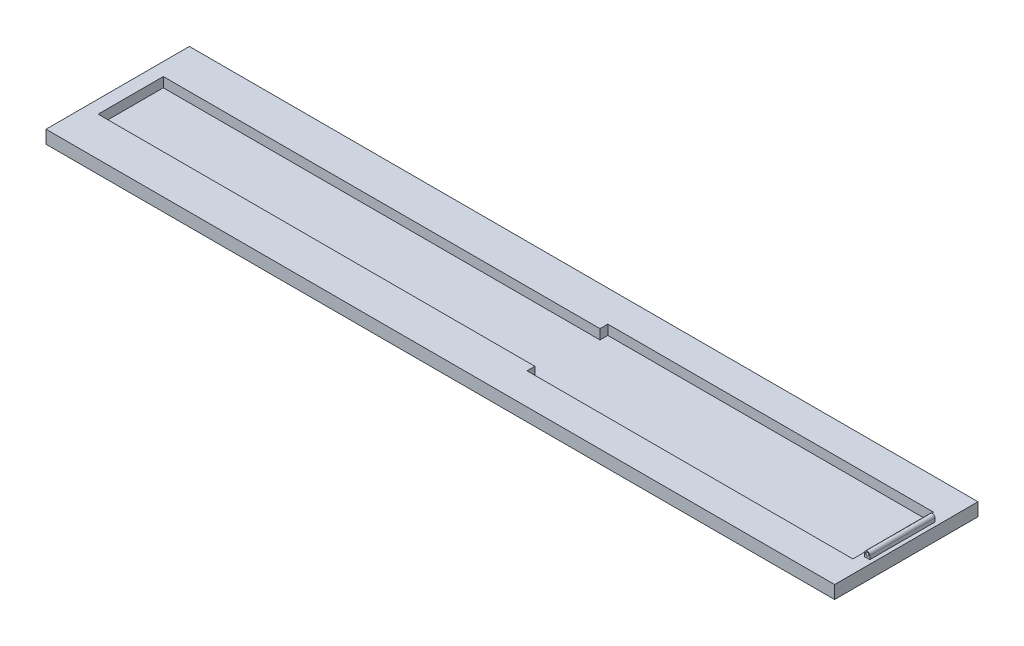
ISO-10303-21;
HEADER;
FILE_DESCRIPTION(('STEP AP214'),'2;1');
FILE_NAME('part.step','',(''),(''),'','','');
FILE_SCHEMA(('AUTOMOTIVE_DESIGN { 1 0 10303 214 1 1 1 1 }'));
ENDSEC;
DATA;
#1=APPLICATION_CONTEXT('core data for automotive mechanical design processes');
#2=APPLICATION_PROTOCOL_DEFINITION('international standard','automotive_design',2000,#1);
#3=PRODUCT_CONTEXT('',#1,'mechanical');
#4=PRODUCT('Part','Part','',(#3));
#5=PRODUCT_RELATED_PRODUCT_CATEGORY('part','',(#4));
#6=PRODUCT_DEFINITION_FORMATION('','',#4);
#7=PRODUCT_DEFINITION_CONTEXT('part definition',#1,'design');
#8=PRODUCT_DEFINITION('design','',#6,#7);
#9=PRODUCT_DEFINITION_SHAPE('','',#8);
#10=(LENGTH_UNIT() NAMED_UNIT(*) SI_UNIT(.MILLI.,.METRE.));
#11=(NAMED_UNIT(*) PLANE_ANGLE_UNIT() SI_UNIT($,.RADIAN.));
#12=(NAMED_UNIT(*) SI_UNIT($,.STERADIAN.) SOLID_ANGLE_UNIT());
#13=UNCERTAINTY_MEASURE_WITH_UNIT(LENGTH_MEASURE(1.E-05),#10,'distance_accuracy_value','');
#14=(GEOMETRIC_REPRESENTATION_CONTEXT(3) GLOBAL_UNCERTAINTY_ASSIGNED_CONTEXT((#13)) GLOBAL_UNIT_ASSIGNED_CONTEXT((#10,
#11,#12)) REPRESENTATION_CONTEXT('',''));
#15=CARTESIAN_POINT('',(0.,0.,0.));
#16=DIRECTION('',(0.,0.,1.));
#17=DIRECTION('',(1.,0.,0.));
#18=AXIS2_PLACEMENT_3D('',#15,#16,#17);
#19=CARTESIAN_POINT('',(-12000.,-55.,1100.));
#20=DIRECTION('',(0.,-1.,0.));
#21=DIRECTION('',(0.,0.,-1.));
#22=AXIS2_PLACEMENT_3D('',#19,#20,#21);
#23=PLANE('',#22);
#24=DIRECTION('',(-1.,0.,0.));
#25=VECTOR('',#24,1.);
#26=CARTESIAN_POINT('',(-5100.,-55.,-500.));
#27=LINE('',#26,#25);
#28=CARTESIAN_POINT('',(-5100.,-55.,-500.));
#29=VERTEX_POINT('',#28);
#30=CARTESIAN_POINT('',(-11800.,-55.,-499.999999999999));
#31=VERTEX_POINT('',#30);
#32=EDGE_CURVE('E185',#29,#31,#27,.T.);
#33=ORIENTED_EDGE('',*,*,#32,.F.);
#34=DIRECTION('',(0.,0.,1.));
#35=VECTOR('',#34,1.);
#36=CARTESIAN_POINT('',(-5100.,-55.,-620.));
#37=LINE('',#36,#35);
#38=CARTESIAN_POINT('',(-5100.,-55.,-620.));
#39=VERTEX_POINT('',#38);
#40=EDGE_CURVE('E46',#39,#29,#37,.T.);
#41=ORIENTED_EDGE('',*,*,#40,.F.);
#42=DIRECTION('',(-1.,0.,0.));
#43=VECTOR('',#42,1.);
#44=CARTESIAN_POINT('',(-5100.,-55.,-620.));
#45=LINE('',#44,#43);
#46=CARTESIAN_POINT('',(-100.,-55.,-620.));
#47=VERTEX_POINT('',#46);
#48=EDGE_CURVE('E165',#47,#39,#45,.T.);
#49=ORIENTED_EDGE('',*,*,#48,.F.);
#50=DIRECTION('',(0.,0.,-1.));
#51=VECTOR('',#50,1.);
#52=CARTESIAN_POINT('',(-100.,-55.,-620.));
#53=LINE('',#52,#51);
#54=CARTESIAN_POINT('',(-100.,-55.,620.));
#55=VERTEX_POINT('',#54);
#56=EDGE_CURVE('E168',#55,#47,#53,.T.);
#57=ORIENTED_EDGE('',*,*,#56,.F.);
#58=DIRECTION('',(1.,0.,0.));
#59=VECTOR('',#58,1.);
#60=CARTESIAN_POINT('',(-5100.,-55.,620.));
#61=LINE('',#60,#59);
#62=CARTESIAN_POINT('',(-5100.,-55.,620.));
#63=VERTEX_POINT('',#62);
#64=EDGE_CURVE('E196',#63,#55,#61,.T.);
#65=ORIENTED_EDGE('',*,*,#64,.F.);
#66=DIRECTION('',(0.,0.,1.));
#67=VECTOR('',#66,1.);
#68=CARTESIAN_POINT('',(-5100.,-55.,500.));
#69=LINE('',#68,#67);
#70=CARTESIAN_POINT('',(-5100.,-55.,500.));
#71=VERTEX_POINT('',#70);
#72=EDGE_CURVE('E193',#71,#63,#69,.T.);
#73=ORIENTED_EDGE('',*,*,#72,.F.);
#74=DIRECTION('',(1.,0.,0.));
#75=VECTOR('',#74,1.);
#76=CARTESIAN_POINT('',(-5100.,-55.,500.));
#77=LINE('',#76,#75);
#78=CARTESIAN_POINT('',(-11800.,-55.,500.000000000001));
#79=VERTEX_POINT('',#78);
#80=EDGE_CURVE('E190',#79,#71,#77,.T.);
#81=ORIENTED_EDGE('',*,*,#80,.F.);
#82=DIRECTION('',(0.,0.,1.));
#83=VECTOR('',#82,1.);
#84=CARTESIAN_POINT('',(-11800.,-55.,-499.999999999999));
#85=LINE('',#84,#83);
#86=EDGE_CURVE('E187',#31,#79,#85,.T.);
#87=ORIENTED_EDGE('',*,*,#86,.F.);
#88=EDGE_LOOP('',(#33,#41,#49,#57,#65,#73,#81,#87));
#89=FACE_BOUND('',#88,.T.);
#90=DIRECTION('',(-1.,0.,0.));
#91=VECTOR('',#90,1.);
#92=CARTESIAN_POINT('',(-12000.,-55.,-1100.));
#93=LINE('',#92,#91);
#94=CARTESIAN_POINT('',(100.,-55.,-1100.));
#95=VERTEX_POINT('',#94);
#96=CARTESIAN_POINT('',(-12000.,-55.,-1100.));
#97=VERTEX_POINT('',#96);
#98=EDGE_CURVE('E254',#95,#97,#93,.T.);
#99=ORIENTED_EDGE('',*,*,#98,.T.);
#100=DIRECTION('',(0.,0.,-1.));
#101=VECTOR('',#100,1.);
#102=CARTESIAN_POINT('',(-12000.,-55.,1100.));
#103=LINE('',#102,#101);
#104=CARTESIAN_POINT('',(-12000.,-55.,1100.));
#105=VERTEX_POINT('',#104);
#106=EDGE_CURVE('E260',#105,#97,#103,.T.);
#107=ORIENTED_EDGE('',*,*,#106,.F.);
#108=DIRECTION('',(-1.,0.,0.));
#109=VECTOR('',#108,1.);
#110=CARTESIAN_POINT('',(-12000.,-55.,1100.));
#111=LINE('',#110,#109);
#112=CARTESIAN_POINT('',(100.,-55.,1100.));
#113=VERTEX_POINT('',#112);
#114=EDGE_CURVE('E258',#113,#105,#111,.T.);
#115=ORIENTED_EDGE('',*,*,#114,.F.);
#116=DIRECTION('',(0.,0.,-1.));
#117=VECTOR('',#116,1.);
#118=CARTESIAN_POINT('',(100.,-55.,1100.));
#119=LINE('',#118,#117);
#120=EDGE_CURVE('E270',#113,#95,#119,.T.);
#121=ORIENTED_EDGE('',*,*,#120,.T.);
#122=EDGE_LOOP('',(#99,#107,#115,#121));
#123=FACE_BOUND('',#122,.T.);
#124=DIRECTION('',(0.,0.,-1.));
#125=VECTOR('',#124,1.);
#126=CARTESIAN_POINT('',(-40.,-55.,500.));
#127=LINE('',#126,#125);
#128=CARTESIAN_POINT('',(-39.9999999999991,-55.,500.));
#129=VERTEX_POINT('',#128);
#130=CARTESIAN_POINT('',(-39.9999999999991,-55.,-500.));
#131=VERTEX_POINT('',#130);
#132=EDGE_CURVE('E244',#129,#131,#127,.T.);
#133=ORIENTED_EDGE('',*,*,#132,.T.);
#134=DIRECTION('',(1.,0.,0.));
#135=VECTOR('',#134,1.);
#136=CARTESIAN_POINT('',(-40.,-55.,-500.));
#137=LINE('',#136,#135);
#138=CARTESIAN_POINT('',(40.,-55.,-500.));
#139=VERTEX_POINT('',#138);
#140=EDGE_CURVE('E236',#131,#139,#137,.T.);
#141=ORIENTED_EDGE('',*,*,#140,.T.);
#142=DIRECTION('',(0.,0.,-1.));
#143=VECTOR('',#142,1.);
#144=CARTESIAN_POINT('',(40.,-55.,500.));
#145=LINE('',#144,#143);
#146=CARTESIAN_POINT('',(39.9999999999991,-55.,500.));
#147=VERTEX_POINT('',#146);
#148=EDGE_CURVE('E241',#147,#139,#145,.T.);
#149=ORIENTED_EDGE('',*,*,#148,.F.);
#150=DIRECTION('',(1.,0.,0.));
#151=VECTOR('',#150,1.);
#152=CARTESIAN_POINT('',(-40.,-55.,500.));
#153=LINE('',#152,#151);
#154=EDGE_CURVE('E54',#129,#147,#153,.T.);
#155=ORIENTED_EDGE('',*,*,#154,.F.);
#156=EDGE_LOOP('',(#133,#141,#149,#155));
#157=FACE_BOUND('',#156,.T.);
#158=ADVANCED_FACE('F31',(#89,#123,#157),#23,.F.);
#159=CARTESIAN_POINT('',(-12000.,-55.,1100.));
#160=DIRECTION('',(1.,0.,0.));
#161=DIRECTION('',(0.,0.,-1.));
#162=AXIS2_PLACEMENT_3D('',#159,#160,#161);
#163=PLANE('',#162);
#164=DIRECTION('',(0.,-1.,0.));
#165=VECTOR('',#164,1.);
#166=CARTESIAN_POINT('',(-12000.,-55.,-1100.));
#167=LINE('',#166,#165);
#168=CARTESIAN_POINT('',(-12000.,-255.,-1100.));
#169=VERTEX_POINT('',#168);
#170=EDGE_CURVE('E249',#97,#169,#167,.T.);
#171=ORIENTED_EDGE('',*,*,#170,.T.);
#172=DIRECTION('',(0.,0.,-1.));
#173=VECTOR('',#172,1.);
#174=CARTESIAN_POINT('',(-12000.,-255.,1100.));
#175=LINE('',#174,#173);
#176=CARTESIAN_POINT('',(-12000.,-255.,1100.));
#177=VERTEX_POINT('',#176);
#178=EDGE_CURVE('E11',#177,#169,#175,.T.);
#179=ORIENTED_EDGE('',*,*,#178,.F.);
#180=DIRECTION('',(0.,-1.,0.));
#181=VECTOR('',#180,1.);
#182=CARTESIAN_POINT('',(-12000.,-55.,1100.));
#183=LINE('',#182,#181);
#184=EDGE_CURVE('E250',#105,#177,#183,.T.);
#185=ORIENTED_EDGE('',*,*,#184,.F.);
#186=ORIENTED_EDGE('',*,*,#106,.T.);
#187=EDGE_LOOP('',(#171,#179,#185,#186));
#188=FACE_BOUND('',#187,.T.);
#189=ADVANCED_FACE('F33',(#188),#163,.F.);
#190=CARTESIAN_POINT('',(-12000.,-255.,1100.));
#191=DIRECTION('',(0.,1.,0.));
#192=DIRECTION('',(0.,0.,1.));
#193=AXIS2_PLACEMENT_3D('',#190,#191,#192);
#194=PLANE('',#193);
#195=DIRECTION('',(1.,0.,0.));
#196=VECTOR('',#195,1.);
#197=CARTESIAN_POINT('',(-12000.,-255.,-1100.));
#198=LINE('',#197,#196);
#199=CARTESIAN_POINT('',(100.,-255.,-1100.));
#200=VERTEX_POINT('',#199);
#201=EDGE_CURVE('E263',#169,#200,#198,.T.);
#202=ORIENTED_EDGE('',*,*,#201,.T.);
#203=DIRECTION('',(0.,0.,-1.));
#204=VECTOR('',#203,1.);
#205=CARTESIAN_POINT('',(100.,-255.,1100.));
#206=LINE('',#205,#204);
#207=CARTESIAN_POINT('',(100.,-255.,1100.));
#208=VERTEX_POINT('',#207);
#209=EDGE_CURVE('E39',#208,#200,#206,.T.);
#210=ORIENTED_EDGE('',*,*,#209,.F.);
#211=DIRECTION('',(1.,0.,0.));
#212=VECTOR('',#211,1.);
#213=CARTESIAN_POINT('',(-12000.,-255.,1100.));
#214=LINE('',#213,#212);
#215=EDGE_CURVE('E253',#177,#208,#214,.T.);
#216=ORIENTED_EDGE('',*,*,#215,.F.);
#217=ORIENTED_EDGE('',*,*,#178,.T.);
#218=EDGE_LOOP('',(#202,#210,#216,#217));
#219=FACE_BOUND('',#218,.T.);
#220=ADVANCED_FACE('F292',(#219),#194,.F.);
#221=CARTESIAN_POINT('',(100.,-55.,1100.));
#222=DIRECTION('',(-1.,0.,0.));
#223=DIRECTION('',(0.,-1.,0.));
#224=AXIS2_PLACEMENT_3D('',#221,#222,#223);
#225=PLANE('',#224);
#226=DIRECTION('',(0.,1.,0.));
#227=VECTOR('',#226,1.);
#228=CARTESIAN_POINT('',(100.,-55.,-1100.));
#229=LINE('',#228,#227);
#230=EDGE_CURVE('E265',#200,#95,#229,.T.);
#231=ORIENTED_EDGE('',*,*,#230,.T.);
#232=ORIENTED_EDGE('',*,*,#120,.F.);
#233=DIRECTION('',(0.,1.,0.));
#234=VECTOR('',#233,1.);
#235=CARTESIAN_POINT('',(100.,-55.,1100.));
#236=LINE('',#235,#234);
#237=EDGE_CURVE('E256',#208,#113,#236,.T.);
#238=ORIENTED_EDGE('',*,*,#237,.F.);
#239=ORIENTED_EDGE('',*,*,#209,.T.);
#240=EDGE_LOOP('',(#231,#232,#238,#239));
#241=FACE_BOUND('',#240,.T.);
#242=ADVANCED_FACE('F277',(#241),#225,.F.);
#243=CARTESIAN_POINT('',(-12000.,-255.,1100.));
#244=DIRECTION('',(0.,0.,1.));
#245=DIRECTION('',(1.,0.,0.));
#246=AXIS2_PLACEMENT_3D('',#243,#244,#245);
#247=PLANE('',#246);
#248=ORIENTED_EDGE('',*,*,#184,.T.);
#249=ORIENTED_EDGE('',*,*,#215,.T.);
#250=ORIENTED_EDGE('',*,*,#237,.T.);
#251=ORIENTED_EDGE('',*,*,#114,.T.);
#252=EDGE_LOOP('',(#248,#249,#250,#251));
#253=FACE_BOUND('',#252,.T.);
#254=ADVANCED_FACE('F291',(#253),#247,.T.);
#255=CARTESIAN_POINT('',(-12000.,-255.,-1100.));
#256=DIRECTION('',(0.,0.,1.));
#257=DIRECTION('',(1.,0.,0.));
#258=AXIS2_PLACEMENT_3D('',#255,#256,#257);
#259=PLANE('',#258);
#260=ORIENTED_EDGE('',*,*,#170,.F.);
#261=ORIENTED_EDGE('',*,*,#98,.F.);
#262=ORIENTED_EDGE('',*,*,#230,.F.);
#263=ORIENTED_EDGE('',*,*,#201,.F.);
#264=EDGE_LOOP('',(#260,#261,#262,#263));
#265=FACE_BOUND('',#264,.T.);
#266=ADVANCED_FACE('F283',(#265),#259,.F.);
#267=CARTESIAN_POINT('',(0.,0.,500.));
#268=DIRECTION('',(0.,0.,1.));
#269=DIRECTION('',(1.,0.,0.));
#270=AXIS2_PLACEMENT_3D('',#267,#268,#269);
#271=PLANE('',#270);
#272=CARTESIAN_POINT('',(0.,0.,500.));
#273=DIRECTION('',(0.,0.,1.));
#274=DIRECTION('',(1.,0.,0.));
#275=AXIS2_PLACEMENT_3D('',#272,#273,#274);
#276=CIRCLE('',#275,40.);
#277=CARTESIAN_POINT('',(40.,0.,500.));
#278=VERTEX_POINT('',#277);
#279=CARTESIAN_POINT('',(-40.,0.,500.));
#280=VERTEX_POINT('',#279);
#281=EDGE_CURVE('E221',#278,#280,#276,.T.);
#282=ORIENTED_EDGE('',*,*,#281,.T.);
#283=DIRECTION('',(0.,-1.,0.));
#284=VECTOR('',#283,1.);
#285=CARTESIAN_POINT('',(-40.,0.,500.));
#286=LINE('',#285,#284);
#287=EDGE_CURVE('E224',#280,#129,#286,.T.);
#288=ORIENTED_EDGE('',*,*,#287,.T.);
#289=ORIENTED_EDGE('',*,*,#154,.T.);
#290=DIRECTION('',(0.,1.,0.));
#291=VECTOR('',#290,1.);
#292=CARTESIAN_POINT('',(40.,-55.,500.));
#293=LINE('',#292,#291);
#294=EDGE_CURVE('E228',#147,#278,#293,.T.);
#295=ORIENTED_EDGE('',*,*,#294,.T.);
#296=EDGE_LOOP('',(#282,#288,#289,#295));
#297=FACE_BOUND('',#296,.T.);
#298=CARTESIAN_POINT('',(0.,0.,500.));
#299=DIRECTION('',(0.,0.,1.));
#300=DIRECTION('',(1.,0.,0.));
#301=AXIS2_PLACEMENT_3D('',#298,#299,#300);
#302=CIRCLE('',#301,25.);
#303=CARTESIAN_POINT('',(25.,0.,500.));
#304=VERTEX_POINT('',#303);
#305=EDGE_CURVE('E215',#304,#304,#302,.T.);
#306=ORIENTED_EDGE('',*,*,#305,.F.);
#307=EDGE_LOOP('',(#306));
#308=FACE_BOUND('',#307,.T.);
#309=ADVANCED_FACE('F307',(#297,#308),#271,.T.);
#310=CARTESIAN_POINT('',(0.,0.,-500.));
#311=DIRECTION('',(0.,0.,1.));
#312=DIRECTION('',(1.,0.,0.));
#313=AXIS2_PLACEMENT_3D('',#310,#311,#312);
#314=PLANE('',#313);
#315=CARTESIAN_POINT('',(0.,0.,-500.));
#316=DIRECTION('',(0.,0.,1.));
#317=DIRECTION('',(1.,0.,0.));
#318=AXIS2_PLACEMENT_3D('',#315,#316,#317);
#319=CIRCLE('',#318,40.);
#320=CARTESIAN_POINT('',(40.,0.,-500.));
#321=VERTEX_POINT('',#320);
#322=CARTESIAN_POINT('',(-40.,0.,-500.));
#323=VERTEX_POINT('',#322);
#324=EDGE_CURVE('E218',#321,#323,#319,.T.);
#325=ORIENTED_EDGE('',*,*,#324,.F.);
#326=DIRECTION('',(0.,1.,0.));
#327=VECTOR('',#326,1.);
#328=CARTESIAN_POINT('',(40.,-55.,-500.));
#329=LINE('',#328,#327);
#330=EDGE_CURVE('E225',#139,#321,#329,.T.);
#331=ORIENTED_EDGE('',*,*,#330,.F.);
#332=ORIENTED_EDGE('',*,*,#140,.F.);
#333=DIRECTION('',(0.,-1.,0.));
#334=VECTOR('',#333,1.);
#335=CARTESIAN_POINT('',(-40.,0.,-500.));
#336=LINE('',#335,#334);
#337=EDGE_CURVE('E233',#323,#131,#336,.T.);
#338=ORIENTED_EDGE('',*,*,#337,.F.);
#339=EDGE_LOOP('',(#325,#331,#332,#338));
#340=FACE_BOUND('',#339,.T.);
#341=CARTESIAN_POINT('',(0.,0.,-500.));
#342=DIRECTION('',(0.,0.,1.));
#343=DIRECTION('',(1.,0.,0.));
#344=AXIS2_PLACEMENT_3D('',#341,#342,#343);
#345=CIRCLE('',#344,25.);
#346=CARTESIAN_POINT('',(25.,0.,-500.));
#347=VERTEX_POINT('',#346);
#348=EDGE_CURVE('E203',#347,#347,#345,.T.);
#349=ORIENTED_EDGE('',*,*,#348,.T.);
#350=EDGE_LOOP('',(#349));
#351=FACE_BOUND('',#350,.T.);
#352=ADVANCED_FACE('F314',(#340,#351),#314,.F.);
#353=CARTESIAN_POINT('',(0.,0.,500.));
#354=DIRECTION('',(0.,0.,-1.));
#355=DIRECTION('',(-1.,0.,0.));
#356=AXIS2_PLACEMENT_3D('',#353,#354,#355);
#357=CYLINDRICAL_SURFACE('',#356,40.);
#358=ORIENTED_EDGE('',*,*,#324,.T.);
#359=DIRECTION('',(0.,0.,-1.));
#360=VECTOR('',#359,1.);
#361=CARTESIAN_POINT('',(-40.,0.,500.));
#362=LINE('',#361,#360);
#363=EDGE_CURVE('E246',#280,#323,#362,.T.);
#364=ORIENTED_EDGE('',*,*,#363,.F.);
#365=ORIENTED_EDGE('',*,*,#281,.F.);
#366=DIRECTION('',(0.,0.,-1.));
#367=VECTOR('',#366,1.);
#368=CARTESIAN_POINT('',(40.,0.,500.));
#369=LINE('',#368,#367);
#370=EDGE_CURVE('E230',#278,#321,#369,.T.);
#371=ORIENTED_EDGE('',*,*,#370,.T.);
#372=EDGE_LOOP('',(#358,#364,#365,#371));
#373=FACE_BOUND('',#372,.T.);
#374=ADVANCED_FACE('F310',(#373),#357,.T.);
#375=CARTESIAN_POINT('',(-40.,0.,500.));
#376=DIRECTION('',(1.,0.,0.));
#377=DIRECTION('',(0.,1.,0.));
#378=AXIS2_PLACEMENT_3D('',#375,#376,#377);
#379=PLANE('',#378);
#380=ORIENTED_EDGE('',*,*,#337,.T.);
#381=ORIENTED_EDGE('',*,*,#132,.F.);
#382=ORIENTED_EDGE('',*,*,#287,.F.);
#383=ORIENTED_EDGE('',*,*,#363,.T.);
#384=EDGE_LOOP('',(#380,#381,#382,#383));
#385=FACE_BOUND('',#384,.T.);
#386=ADVANCED_FACE('F313',(#385),#379,.F.);
#387=CARTESIAN_POINT('',(40.,-55.,500.));
#388=DIRECTION('',(-1.,0.,0.));
#389=DIRECTION('',(0.,0.,1.));
#390=AXIS2_PLACEMENT_3D('',#387,#388,#389);
#391=PLANE('',#390);
#392=ORIENTED_EDGE('',*,*,#330,.T.);
#393=ORIENTED_EDGE('',*,*,#370,.F.);
#394=ORIENTED_EDGE('',*,*,#294,.F.);
#395=ORIENTED_EDGE('',*,*,#148,.T.);
#396=EDGE_LOOP('',(#392,#393,#394,#395));
#397=FACE_BOUND('',#396,.T.);
#398=ADVANCED_FACE('F318',(#397),#391,.F.);
#399=CARTESIAN_POINT('',(0.,0.,500.));
#400=DIRECTION('',(0.,0.,-1.));
#401=DIRECTION('',(-1.,0.,0.));
#402=AXIS2_PLACEMENT_3D('',#399,#400,#401);
#403=CYLINDRICAL_SURFACE('',#402,25.);
#404=ORIENTED_EDGE('',*,*,#305,.T.);
#405=EDGE_LOOP('',(#404));
#406=FACE_BOUND('',#405,.T.);
#407=ORIENTED_EDGE('',*,*,#348,.F.);
#408=EDGE_LOOP('',(#407));
#409=FACE_BOUND('',#408,.T.);
#410=ADVANCED_FACE('F322',(#406,#409),#403,.F.);
#411=CARTESIAN_POINT('',(-5100.,-205.,-620.));
#412=DIRECTION('',(-1.,0.,0.));
#413=DIRECTION('',(0.,0.,1.));
#414=AXIS2_PLACEMENT_3D('',#411,#412,#413);
#415=PLANE('',#414);
#416=ORIENTED_EDGE('',*,*,#40,.T.);
#417=DIRECTION('',(0.,1.,0.));
#418=VECTOR('',#417,1.);
#419=CARTESIAN_POINT('',(-5100.,-205.,-500.));
#420=LINE('',#419,#418);
#421=CARTESIAN_POINT('',(-5100.,-205.,-500.));
#422=VERTEX_POINT('',#421);
#423=EDGE_CURVE('E142',#422,#29,#420,.T.);
#424=ORIENTED_EDGE('',*,*,#423,.F.);
#425=DIRECTION('',(0.,0.,1.));
#426=VECTOR('',#425,1.);
#427=CARTESIAN_POINT('',(-5100.,-205.,-620.));
#428=LINE('',#427,#426);
#429=CARTESIAN_POINT('',(-5100.,-205.,-620.));
#430=VERTEX_POINT('',#429);
#431=EDGE_CURVE('E146',#430,#422,#428,.T.);
#432=ORIENTED_EDGE('',*,*,#431,.F.);
#433=DIRECTION('',(0.,1.,0.));
#434=VECTOR('',#433,1.);
#435=CARTESIAN_POINT('',(-5100.,-205.,-620.));
#436=LINE('',#435,#434);
#437=EDGE_CURVE('E201',#430,#39,#436,.T.);
#438=ORIENTED_EDGE('',*,*,#437,.T.);
#439=EDGE_LOOP('',(#416,#424,#432,#438));
#440=FACE_BOUND('',#439,.T.);
#441=ADVANCED_FACE('F144',(#440),#415,.F.);
#442=CARTESIAN_POINT('',(-5100.,-205.,-620.));
#443=DIRECTION('',(0.,0.,-1.));
#444=DIRECTION('',(-1.,0.,0.));
#445=AXIS2_PLACEMENT_3D('',#442,#443,#444);
#446=PLANE('',#445);
#447=ORIENTED_EDGE('',*,*,#48,.T.);
#448=ORIENTED_EDGE('',*,*,#437,.F.);
#449=DIRECTION('',(-1.,0.,0.));
#450=VECTOR('',#449,1.);
#451=CARTESIAN_POINT('',(-5100.,-205.,-620.));
#452=LINE('',#451,#450);
#453=CARTESIAN_POINT('',(-100.,-205.,-620.));
#454=VERTEX_POINT('',#453);
#455=EDGE_CURVE('E152',#454,#430,#452,.T.);
#456=ORIENTED_EDGE('',*,*,#455,.F.);
#457=DIRECTION('',(0.,1.,0.));
#458=VECTOR('',#457,1.);
#459=CARTESIAN_POINT('',(-100.,-205.,-620.));
#460=LINE('',#459,#458);
#461=EDGE_CURVE('E204',#454,#47,#460,.T.);
#462=ORIENTED_EDGE('',*,*,#461,.T.);
#463=EDGE_LOOP('',(#447,#448,#456,#462));
#464=FACE_BOUND('',#463,.T.);
#465=ADVANCED_FACE('F335',(#464),#446,.F.);
#466=CARTESIAN_POINT('',(-100.,-205.,-620.));
#467=DIRECTION('',(1.,0.,0.));
#468=DIRECTION('',(0.,0.,-1.));
#469=AXIS2_PLACEMENT_3D('',#466,#467,#468);
#470=PLANE('',#469);
#471=ORIENTED_EDGE('',*,*,#56,.T.);
#472=ORIENTED_EDGE('',*,*,#461,.F.);
#473=DIRECTION('',(0.,0.,-1.));
#474=VECTOR('',#473,1.);
#475=CARTESIAN_POINT('',(-100.,-205.,-620.));
#476=LINE('',#475,#474);
#477=CARTESIAN_POINT('',(-100.,-205.,620.));
#478=VERTEX_POINT('',#477);
#479=EDGE_CURVE('E181',#478,#454,#476,.T.);
#480=ORIENTED_EDGE('',*,*,#479,.F.);
#481=DIRECTION('',(0.,1.,0.));
#482=VECTOR('',#481,1.);
#483=CARTESIAN_POINT('',(-100.,-205.,620.));
#484=LINE('',#483,#482);
#485=EDGE_CURVE('E206',#478,#55,#484,.T.);
#486=ORIENTED_EDGE('',*,*,#485,.T.);
#487=EDGE_LOOP('',(#471,#472,#480,#486));
#488=FACE_BOUND('',#487,.T.);
#489=ADVANCED_FACE('F353',(#488),#470,.F.);
#490=CARTESIAN_POINT('',(-5100.,-205.,620.));
#491=DIRECTION('',(0.,0.,1.));
#492=DIRECTION('',(1.,0.,0.));
#493=AXIS2_PLACEMENT_3D('',#490,#491,#492);
#494=PLANE('',#493);
#495=ORIENTED_EDGE('',*,*,#64,.T.);
#496=ORIENTED_EDGE('',*,*,#485,.F.);
#497=DIRECTION('',(1.,0.,0.));
#498=VECTOR('',#497,1.);
#499=CARTESIAN_POINT('',(-5100.,-205.,620.));
#500=LINE('',#499,#498);
#501=CARTESIAN_POINT('',(-5100.,-205.,620.));
#502=VERTEX_POINT('',#501);
#503=EDGE_CURVE('E178',#502,#478,#500,.T.);
#504=ORIENTED_EDGE('',*,*,#503,.F.);
#505=DIRECTION('',(0.,1.,0.));
#506=VECTOR('',#505,1.);
#507=CARTESIAN_POINT('',(-5100.,-205.,620.));
#508=LINE('',#507,#506);
#509=EDGE_CURVE('E208',#502,#63,#508,.T.);
#510=ORIENTED_EDGE('',*,*,#509,.T.);
#511=EDGE_LOOP('',(#495,#496,#504,#510));
#512=FACE_BOUND('',#511,.T.);
#513=ADVANCED_FACE('F349',(#512),#494,.F.);
#514=CARTESIAN_POINT('',(-5100.,-205.,500.));
#515=DIRECTION('',(-1.,0.,0.));
#516=DIRECTION('',(0.,0.,1.));
#517=AXIS2_PLACEMENT_3D('',#514,#515,#516);
#518=PLANE('',#517);
#519=ORIENTED_EDGE('',*,*,#72,.T.);
#520=ORIENTED_EDGE('',*,*,#509,.F.);
#521=DIRECTION('',(0.,0.,1.));
#522=VECTOR('',#521,1.);
#523=CARTESIAN_POINT('',(-5100.,-205.,500.));
#524=LINE('',#523,#522);
#525=CARTESIAN_POINT('',(-5100.,-205.,500.));
#526=VERTEX_POINT('',#525);
#527=EDGE_CURVE('E175',#526,#502,#524,.T.);
#528=ORIENTED_EDGE('',*,*,#527,.F.);
#529=DIRECTION('',(0.,1.,0.));
#530=VECTOR('',#529,1.);
#531=CARTESIAN_POINT('',(-5100.,-205.,500.));
#532=LINE('',#531,#530);
#533=EDGE_CURVE('E210',#526,#71,#532,.T.);
#534=ORIENTED_EDGE('',*,*,#533,.T.);
#535=EDGE_LOOP('',(#519,#520,#528,#534));
#536=FACE_BOUND('',#535,.T.);
#537=ADVANCED_FACE('F345',(#536),#518,.F.);
#538=CARTESIAN_POINT('',(-5100.,-205.,500.));
#539=DIRECTION('',(0.,0.,1.));
#540=DIRECTION('',(1.,0.,0.));
#541=AXIS2_PLACEMENT_3D('',#538,#539,#540);
#542=PLANE('',#541);
#543=ORIENTED_EDGE('',*,*,#80,.T.);
#544=ORIENTED_EDGE('',*,*,#533,.F.);
#545=DIRECTION('',(1.,0.,0.));
#546=VECTOR('',#545,1.);
#547=CARTESIAN_POINT('',(-5100.,-205.,500.));
#548=LINE('',#547,#546);
#549=CARTESIAN_POINT('',(-11800.,-205.,500.000000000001));
#550=VERTEX_POINT('',#549);
#551=EDGE_CURVE('E172',#550,#526,#548,.T.);
#552=ORIENTED_EDGE('',*,*,#551,.F.);
#553=DIRECTION('',(0.,1.,0.));
#554=VECTOR('',#553,1.);
#555=CARTESIAN_POINT('',(-11800.,-205.,500.000000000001));
#556=LINE('',#555,#554);
#557=EDGE_CURVE('E212',#550,#79,#556,.T.);
#558=ORIENTED_EDGE('',*,*,#557,.T.);
#559=EDGE_LOOP('',(#543,#544,#552,#558));
#560=FACE_BOUND('',#559,.T.);
#561=ADVANCED_FACE('F341',(#560),#542,.F.);
#562=CARTESIAN_POINT('',(-11800.,-205.,-499.999999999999));
#563=DIRECTION('',(-1.,0.,0.));
#564=DIRECTION('',(0.,0.,1.));
#565=AXIS2_PLACEMENT_3D('',#562,#563,#564);
#566=PLANE('',#565);
#567=ORIENTED_EDGE('',*,*,#86,.T.);
#568=ORIENTED_EDGE('',*,*,#557,.F.);
#569=DIRECTION('',(0.,0.,1.));
#570=VECTOR('',#569,1.);
#571=CARTESIAN_POINT('',(-11800.,-205.,-499.999999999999));
#572=LINE('',#571,#570);
#573=CARTESIAN_POINT('',(-11800.,-205.,-499.999999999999));
#574=VERTEX_POINT('',#573);
#575=EDGE_CURVE('E160',#574,#550,#572,.T.);
#576=ORIENTED_EDGE('',*,*,#575,.F.);
#577=DIRECTION('',(0.,1.,0.));
#578=VECTOR('',#577,1.);
#579=CARTESIAN_POINT('',(-11800.,-205.,-499.999999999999));
#580=LINE('',#579,#578);
#581=EDGE_CURVE('E151',#574,#31,#580,.T.);
#582=ORIENTED_EDGE('',*,*,#581,.T.);
#583=EDGE_LOOP('',(#567,#568,#576,#582));
#584=FACE_BOUND('',#583,.T.);
#585=ADVANCED_FACE('F338',(#584),#566,.F.);
#586=CARTESIAN_POINT('',(-5100.,-205.,-500.));
#587=DIRECTION('',(0.,0.,-1.));
#588=DIRECTION('',(-1.,0.,0.));
#589=AXIS2_PLACEMENT_3D('',#586,#587,#588);
#590=PLANE('',#589);
#591=ORIENTED_EDGE('',*,*,#32,.T.);
#592=ORIENTED_EDGE('',*,*,#581,.F.);
#593=DIRECTION('',(-1.,0.,0.));
#594=VECTOR('',#593,1.);
#595=CARTESIAN_POINT('',(-5100.,-205.,-500.));
#596=LINE('',#595,#594);
#597=EDGE_CURVE('E155',#422,#574,#596,.T.);
#598=ORIENTED_EDGE('',*,*,#597,.F.);
#599=ORIENTED_EDGE('',*,*,#423,.T.);
#600=EDGE_LOOP('',(#591,#592,#598,#599));
#601=FACE_BOUND('',#600,.T.);
#602=ADVANCED_FACE('F156',(#601),#590,.F.);
#603=CARTESIAN_POINT('',(-5100.,-205.,620.));
#604=DIRECTION('',(0.,1.,0.));
#605=DIRECTION('',(0.,0.,1.));
#606=AXIS2_PLACEMENT_3D('',#603,#604,#605);
#607=PLANE('',#606);
#608=ORIENTED_EDGE('',*,*,#431,.T.);
#609=ORIENTED_EDGE('',*,*,#597,.T.);
#610=ORIENTED_EDGE('',*,*,#575,.T.);
#611=ORIENTED_EDGE('',*,*,#551,.T.);
#612=ORIENTED_EDGE('',*,*,#527,.T.);
#613=ORIENTED_EDGE('',*,*,#503,.T.);
#614=ORIENTED_EDGE('',*,*,#479,.T.);
#615=ORIENTED_EDGE('',*,*,#455,.T.);
#616=EDGE_LOOP('',(#608,#609,#610,#611,#612,#613,#614,#615));
#617=FACE_BOUND('',#616,.T.);
#618=ADVANCED_FACE('F162',(#617),#607,.T.);
#619=CLOSED_SHELL('',(#158,#189,#220,#242,#254,#266,#309,#352,#374,#386,#398,#410,#441,#465,
#489,#513,#537,#561,#585,#602,#618));
#620=MANIFOLD_SOLID_BREP('B2',#619);
#621=ADVANCED_BREP_SHAPE_REPRESENTATION('',(#18,#620),#14);
#622=SHAPE_DEFINITION_REPRESENTATION(#9,#621);
ENDSEC;
END-ISO-10303-21;
